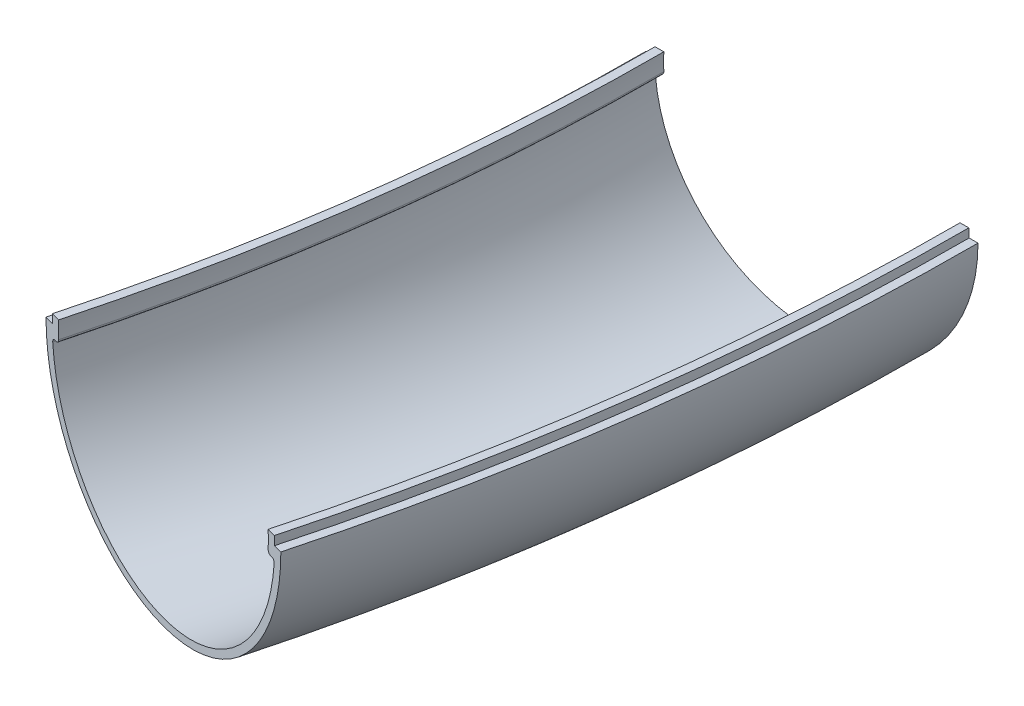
from build123d import *

# Parameters (mm, degrees)
REVOLVE_1_ANGLE = 15


with BuildPart() as part:
    # Sketch 1 → Revolve 1 (revolve)
    with BuildSketch(Plane.XY):
        with BuildLine():
            Line((186.622535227, 0.776811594), (185.829484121, 0.776811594))
            ThreePointArc((185.829484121, 0.776811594), (185.809425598, 0.388607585), (185.8, 0))
            Line((185.8, 0), (185, 0))
            ThreePointArc((185, 0), (200, -15), (215, 0))
            Line((215, 0), (214.2, 0))
            ThreePointArc((214.2, 0), (214.190574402, 0.388607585), (214.170515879, 0.776811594))
            Line((214.170515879, 0.776811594), (213.377464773, 0.776811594))
            ThreePointArc((213.377464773, 0.776811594), (213.39999999, -0.000515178), (213.377405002, -0.777840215))
            ThreePointArc((213.377405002, -0.777840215), (213.458697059, -1.001137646), (213.676899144, -1.095254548))
            Line((213.676899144, -1.095254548), (213.844903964, -1.095254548))
            ThreePointArc((213.844903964, -1.095254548), (214.066333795, -1.192846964), (214.143697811, -1.422129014))
            ThreePointArc((214.143697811, -1.422129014), (200, -14.350792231), (185.856302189, -1.422129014))
            ThreePointArc((185.856302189, -1.422129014), (185.933666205, -1.192846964), (186.155096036, -1.095254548))
            Line((186.155096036, -1.095254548), (186.323100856, -1.095254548))
            ThreePointArc((186.323100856, -1.095254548), (186.541302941, -1.001137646), (186.622594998, -0.777840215))
            ThreePointArc((186.622594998, -0.777840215), (186.60000001, -0.000515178), (186.622535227, 0.776811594))
        make_face()
    revolve(axis=Axis((0, 44.11016669, 0), (0, -1, 0)), revolution_arc=REVOLVE_1_ANGLE)


solid = part.part
